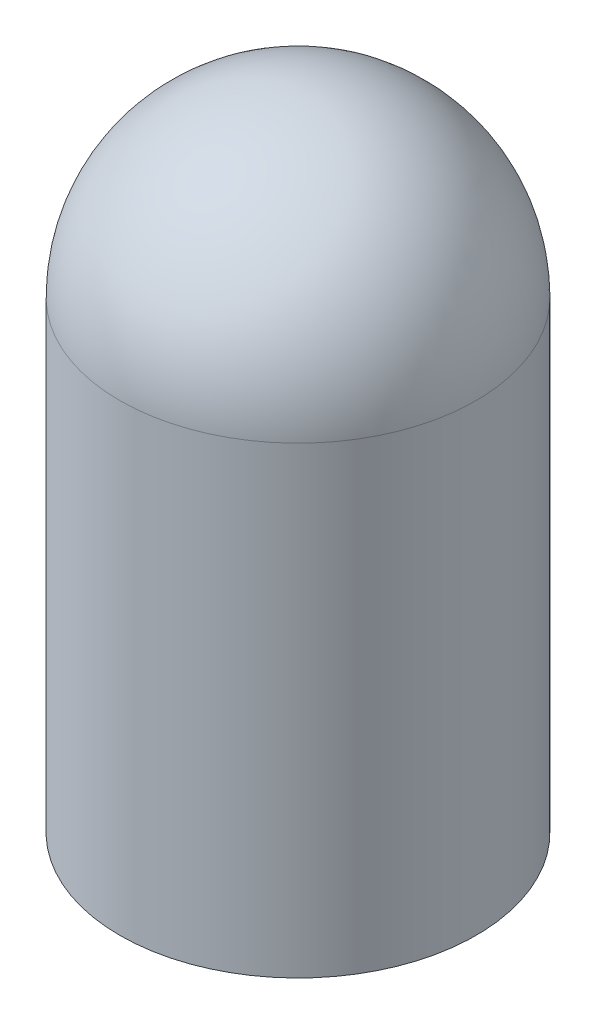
ISO-10303-21;
HEADER;
FILE_DESCRIPTION(('STEP AP214'),'2;1');
FILE_NAME('part.step','',(''),(''),'','','');
FILE_SCHEMA(('AUTOMOTIVE_DESIGN { 1 0 10303 214 1 1 1 1 }'));
ENDSEC;
DATA;
#1=APPLICATION_CONTEXT('core data for automotive mechanical design processes');
#2=APPLICATION_PROTOCOL_DEFINITION('international standard','automotive_design',2000,#1);
#3=PRODUCT_CONTEXT('',#1,'mechanical');
#4=PRODUCT('Part','Part','',(#3));
#5=PRODUCT_RELATED_PRODUCT_CATEGORY('part','',(#4));
#6=PRODUCT_DEFINITION_FORMATION('','',#4);
#7=PRODUCT_DEFINITION_CONTEXT('part definition',#1,'design');
#8=PRODUCT_DEFINITION('design','',#6,#7);
#9=PRODUCT_DEFINITION_SHAPE('','',#8);
#10=(LENGTH_UNIT() NAMED_UNIT(*) SI_UNIT(.MILLI.,.METRE.));
#11=(NAMED_UNIT(*) PLANE_ANGLE_UNIT() SI_UNIT($,.RADIAN.));
#12=(NAMED_UNIT(*) SI_UNIT($,.STERADIAN.) SOLID_ANGLE_UNIT());
#13=UNCERTAINTY_MEASURE_WITH_UNIT(LENGTH_MEASURE(1.E-05),#10,'distance_accuracy_value','');
#14=(GEOMETRIC_REPRESENTATION_CONTEXT(3) GLOBAL_UNCERTAINTY_ASSIGNED_CONTEXT((#13)) GLOBAL_UNIT_ASSIGNED_CONTEXT((#10,
#11,#12)) REPRESENTATION_CONTEXT('',''));
#15=CARTESIAN_POINT('',(0.,0.,0.));
#16=DIRECTION('',(0.,0.,1.));
#17=DIRECTION('',(1.,0.,0.));
#18=AXIS2_PLACEMENT_3D('',#15,#16,#17);
#19=CARTESIAN_POINT('',(0.,18.,0.));
#20=DIRECTION('',(0.,-1.,0.));
#21=DIRECTION('',(0.,0.,-1.));
#22=AXIS2_PLACEMENT_3D('',#19,#20,#21);
#23=CYLINDRICAL_SURFACE('',#22,5.);
#24=CARTESIAN_POINT('',(0.,13.,0.));
#25=DIRECTION('',(0.,-1.,0.));
#26=DIRECTION('',(0.,0.,-1.));
#27=AXIS2_PLACEMENT_3D('',#24,#25,#26);
#28=CIRCLE('',#27,5.);
#29=CARTESIAN_POINT('',(0.,13.,-5.));
#30=VERTEX_POINT('',#29);
#31=EDGE_CURVE('E11',#30,#30,#28,.T.);
#32=ORIENTED_EDGE('',*,*,#31,.T.);
#33=EDGE_LOOP('',(#32));
#34=FACE_BOUND('',#33,.T.);
#35=CARTESIAN_POINT('',(0.,0.,0.));
#36=DIRECTION('',(0.,1.,0.));
#37=DIRECTION('',(0.,0.,1.));
#38=AXIS2_PLACEMENT_3D('',#35,#36,#37);
#39=CIRCLE('',#38,5.);
#40=CARTESIAN_POINT('',(0.,0.,5.));
#41=VERTEX_POINT('',#40);
#42=EDGE_CURVE('E42',#41,#41,#39,.T.);
#43=ORIENTED_EDGE('',*,*,#42,.T.);
#44=EDGE_LOOP('',(#43));
#45=FACE_BOUND('',#44,.T.);
#46=ADVANCED_FACE('F35',(#34,#45),#23,.T.);
#47=CARTESIAN_POINT('',(0.,0.,0.));
#48=DIRECTION('',(0.,1.,0.));
#49=DIRECTION('',(0.,0.,1.));
#50=AXIS2_PLACEMENT_3D('',#47,#48,#49);
#51=PLANE('',#50);
#52=CARTESIAN_POINT('',(0.,0.,0.));
#53=DIRECTION('',(0.,-1.,0.));
#54=DIRECTION('',(0.,0.,-1.));
#55=AXIS2_PLACEMENT_3D('',#52,#53,#54);
#56=CIRCLE('',#55,2.01929999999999);
#57=CARTESIAN_POINT('',(0.,0.,-2.01929999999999));
#58=VERTEX_POINT('',#57);
#59=EDGE_CURVE('E54',#58,#58,#56,.T.);
#60=ORIENTED_EDGE('',*,*,#59,.F.);
#61=EDGE_LOOP('',(#60));
#62=FACE_BOUND('',#61,.T.);
#63=ORIENTED_EDGE('',*,*,#42,.F.);
#64=EDGE_LOOP('',(#63));
#65=FACE_BOUND('',#64,.T.);
#66=ADVANCED_FACE('F62',(#62,#65),#51,.F.);
#67=CARTESIAN_POINT('',(0.,13.,0.));
#68=DIRECTION('',(0.,1.,0.));
#69=DIRECTION('',(0.,0.,1.));
#70=AXIS2_PLACEMENT_3D('',#67,#68,#69);
#71=SPHERICAL_SURFACE('',#70,5.);
#72=ORIENTED_EDGE('',*,*,#31,.F.);
#73=EDGE_LOOP('',(#72));
#74=FACE_BOUND('',#73,.T.);
#75=ADVANCED_FACE('F37',(#74),#71,.T.);
#76=CARTESIAN_POINT('',(0.,13.,0.));
#77=DIRECTION('',(0.,-1.,0.));
#78=DIRECTION('',(0.,0.,-1.));
#79=AXIS2_PLACEMENT_3D('',#76,#77,#78);
#80=CONICAL_SURFACE('',#79,2.0193,1.02974425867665);
#81=CARTESIAN_POINT('',(0.,14.2133178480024,0.));
#82=VERTEX_POINT('',#81);
#83=VERTEX_LOOP('',#82);
#84=FACE_BOUND('',#83,.T.);
#85=CARTESIAN_POINT('',(0.,13.,0.));
#86=DIRECTION('',(0.,-1.,0.));
#87=DIRECTION('',(0.,0.,-1.));
#88=AXIS2_PLACEMENT_3D('',#85,#86,#87);
#89=CIRCLE('',#88,2.0193);
#90=CARTESIAN_POINT('',(0.,13.,-2.0193));
#91=VERTEX_POINT('',#90);
#92=EDGE_CURVE('E52',#91,#91,#89,.T.);
#93=ORIENTED_EDGE('',*,*,#92,.T.);
#94=EDGE_LOOP('',(#93));
#95=FACE_BOUND('',#94,.T.);
#96=ADVANCED_FACE('F45',(#84,#95),#80,.F.);
#97=CARTESIAN_POINT('',(0.,0.,0.));
#98=DIRECTION('',(0.,-1.,0.));
#99=DIRECTION('',(0.,0.,-1.));
#100=AXIS2_PLACEMENT_3D('',#97,#98,#99);
#101=CYLINDRICAL_SURFACE('',#100,2.01929999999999);
#102=ORIENTED_EDGE('',*,*,#92,.F.);
#103=EDGE_LOOP('',(#102));
#104=FACE_BOUND('',#103,.T.);
#105=ORIENTED_EDGE('',*,*,#59,.T.);
#106=EDGE_LOOP('',(#105));
#107=FACE_BOUND('',#106,.T.);
#108=ADVANCED_FACE('F48',(#104,#107),#101,.F.);
#109=CLOSED_SHELL('',(#46,#66,#75,#96,#108));
#110=MANIFOLD_SOLID_BREP('B2',#109);
#111=ADVANCED_BREP_SHAPE_REPRESENTATION('',(#18,#110),#14);
#112=SHAPE_DEFINITION_REPRESENTATION(#9,#111);
ENDSEC;
END-ISO-10303-21;
